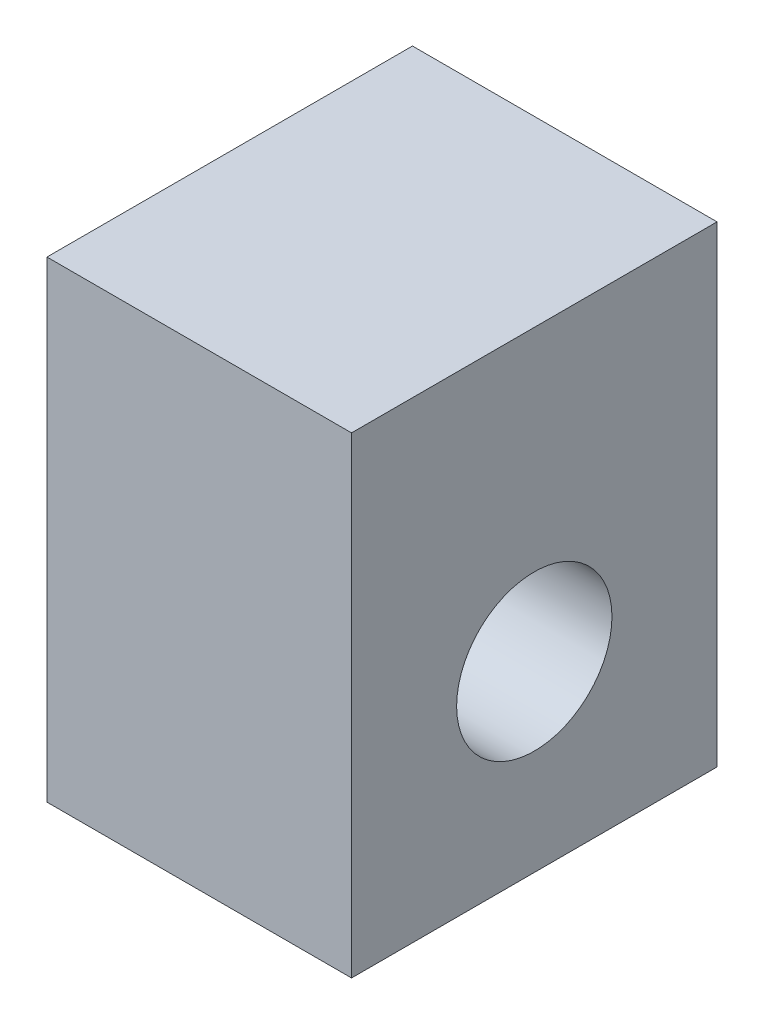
from build123d import *

# Parameters (mm, degrees)
SKETCH_1_W                      = 20
SKETCH_1_H                      = 38
SCREW_BEARING_BLOCK_DEPTH       = 12
SKETCH_2_R                      = 4.2
SCREW_BORE_D8P4_DEPTH           = 25
SKETCH_3_W                      = 60
SKETCH_3_H                      = 36
BEARING_FOOT_AT_YMINUS12_DEPTH  = 50
SKETCH_4_R                      = 5.1
BEARING_INSERT_SEAT_D10P2_DEPTH = 25


with BuildPart() as part:
    # Sketch 1 → Screw_Bearing_Block (new, symmetric)
    with BuildSketch(Plane.XY):
        Rectangle(SKETCH_1_W, SKETCH_1_H)
    extrude(amount=SCREW_BEARING_BLOCK_DEPTH, both=True)

    # Sketch 2 → Screw_Bore_D8p4 (cut, symmetric)
    with BuildSketch(Plane(origin=(0, 0, 0), x_dir=(0, 0, -1), z_dir=(1, 0, 0))):
        Circle(SKETCH_2_R)
    extrude(amount=SCREW_BORE_D8P4_DEPTH, both=True, mode=Mode.SUBTRACT)

    # Sketch 3 → Bearing_Foot_At_Yminus12 (cut, symmetric)
    with BuildSketch(Plane.XY):
        with Locations((0, -30)):
            Rectangle(SKETCH_3_W, SKETCH_3_H)
    extrude(amount=BEARING_FOOT_AT_YMINUS12_DEPTH, both=True, mode=Mode.SUBTRACT)

    # Sketch 4 → Bearing_Insert_Seat_D10p2 (cut, symmetric)
    with BuildSketch(Plane(origin=(0, 0, 0), x_dir=(0, 0, -1), z_dir=(1, 0, 0))):
        Circle(SKETCH_4_R)
    extrude(amount=BEARING_INSERT_SEAT_D10P2_DEPTH, both=True, mode=Mode.SUBTRACT)


solid = part.part
